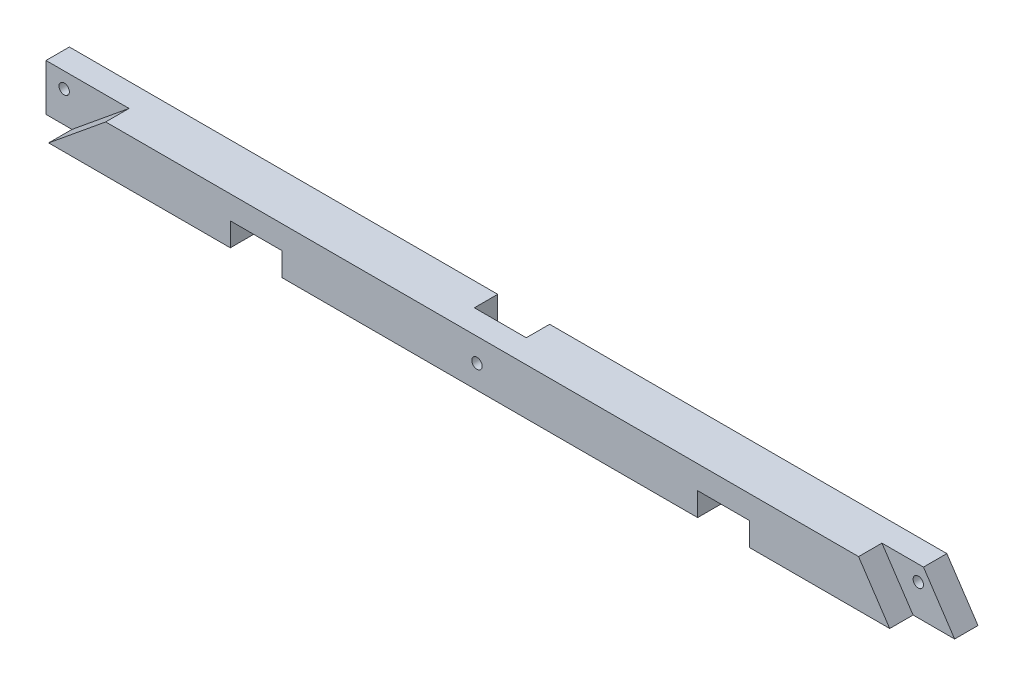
from build123d import *

# Parameters (mm, degrees)
ESQUISSE1_W             = 175
ESQUISSE1_H             = 9
EXTRUSION1_DEPTH        = 9
ENL_V_MAT_EXTRU_1_DEPTH = 4.5
ESQUISSE3_R             = 1
ENL_V_MAT_EXTRU_2_DEPTH = 4.5
ENL_V_MAT_EXTRU_3_DEPTH = 9
ENL_V_MAT_EXTRU_4_DEPTH = 4.5
ESQUISSE6_R             = 1
ENL_V_MAT_EXTRU_5_DEPTH = 4.5
ESQUISSE7_W             = 10
ESQUISSE7_H             = 9
ENL_V_MAT_EXTRU_6_DEPTH = 4.5
ESQUISSE8_R             = 1
ENL_V_MAT_EXTRU_7_DEPTH = 4.5
ESQUISSE9_W             = 10
ESQUISSE9_H             = 4.5
ENL_V_MAT_EXTRU_8_DEPTH = 9


with BuildPart() as part:
    # Esquisse1 → Extrusion1 (new body)
    with BuildSketch(Plane.XY):
        with Locations((87.5, 4.5)):
            Rectangle(ESQUISSE1_W, ESQUISSE1_H)
    extrude(amount=EXTRUSION1_DEPTH)

    # Esquisse2 → Enl_v. mat.-Extru.1 (cut)
    with BuildSketch(Plane.XY.offset(9)):
        Polygon((0, 9), (16, 9), (5, 0), (0, 0), align=None)
    extrude(amount=-ENL_V_MAT_EXTRU_1_DEPTH, mode=Mode.SUBTRACT)

    # Esquisse3 → Enl_v. mat.-Extru.2 (cut)
    with BuildSketch(Plane.XY.offset(4.5)):
        with Locations((3.5, 6)):
            Circle(ESQUISSE3_R)
    extrude(amount=-ENL_V_MAT_EXTRU_2_DEPTH, mode=Mode.SUBTRACT)

    # Esquisse4 → Enl_v. mat.-Extru.3 (cut)
    with BuildSketch(Plane.XY.offset(9)):
        Polygon((175, 9), (169, 9), (175, 0), align=None)
    extrude(amount=-ENL_V_MAT_EXTRU_3_DEPTH, mode=Mode.SUBTRACT)

    # Esquisse5 → Enl_v. mat.-Extru.4 (cut)
    with BuildSketch(Plane.XY.offset(9)):
        Polygon((169, 9), (161, 9), (167, 0), (175, 0), align=None)
    extrude(amount=-ENL_V_MAT_EXTRU_4_DEPTH, mode=Mode.SUBTRACT)

    # Esquisse6 → Enl_v. mat.-Extru.5 (cut)
    with BuildSketch(Plane.XY.offset(4.5)):
        with Locations((168, 6)):
            Circle(ESQUISSE6_R)
    extrude(amount=-ENL_V_MAT_EXTRU_5_DEPTH, mode=Mode.SUBTRACT)

    # Esquisse7 → Enl_v. mat.-Extru.6 (cut)
    with BuildSketch(Plane(origin=(0, 0, 0), x_dir=(-1, 0, 0), z_dir=(0, 0, -1))):
        with Locations((-87.5, 4.5)):
            Rectangle(ESQUISSE7_W, ESQUISSE7_H)
    extrude(amount=-ENL_V_MAT_EXTRU_6_DEPTH, mode=Mode.SUBTRACT)

    # Esquisse8 → Enl_v. mat.-Extru.7 (cut)
    with BuildSketch(Plane(origin=(0, 0, 4.5), x_dir=(-1, 0, 0), z_dir=(0, 0, -1))):
        with Locations((-87.5, 4.5)):
            Circle(ESQUISSE8_R)
    extrude(amount=-ENL_V_MAT_EXTRU_7_DEPTH, mode=Mode.SUBTRACT)

    # Esquisse9 → Enl_v. mat.-Extru.8 (cut)
    with BuildSketch(Plane(origin=(0, 0, 0), x_dir=(-1, 0, 0), z_dir=(0, 0, -1))):
        with Locations((-45, 2.25)):
            Rectangle(ESQUISSE9_W, ESQUISSE9_H)
        with Locations((-135, 2.25)):
            Rectangle(ESQUISSE9_W, ESQUISSE9_H)
    extrude(amount=-ENL_V_MAT_EXTRU_8_DEPTH, mode=Mode.SUBTRACT)


solid = part.part
